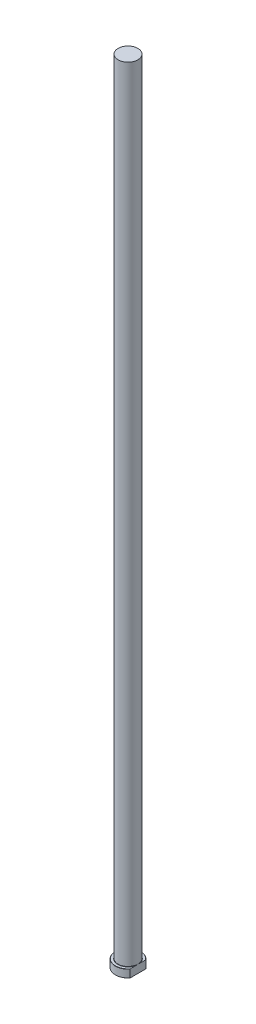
from build123d import *
from build123d.topology import SkipClean

# Parameters (mm, degrees)
CHAMFER1_SIZE = 0.2
FILLET1_R     = 0.3
KEY_DEPTH     = 1001.25596724


with BuildPart() as part:
    # Sketch1 → Revolve1 (revolve)
    with BuildSketch(Plane.XY, mode=Mode.PRIVATE) as revolve1_sk:
        Polygon((0, 0), (-16, 0), (-16, 10), (-12.5, 10), (-12.5, 1000), (0, 1000), align=None)
    revolve(revolve1_sk.sketch.rotate(Axis((0, 259.958771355, 0), (0, -1, 0)), 270), axis=Axis((0, 259.958771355, 0), (0, -1, 0)))

    # Chamfer1
    chamfer1_edges = [part.edges().sort_by_distance(p)[0] for p in [
        (0, 10, -16),
        (0, 0, -16),
    ]]
    chamfer(chamfer1_edges, length=CHAMFER1_SIZE)

    # Fillet1
    fillet1_edges = [part.edges().sort_by_distance(p)[0] for p in [
        (0, 10, -12.5),
    ]]
    fillet(fillet1_edges, radius=FILLET1_R)

    # Sketch2 → KEY (cut, through all)
    with SkipClean():  # the faces are left unmerged after this step: merging them gives an invalid solid
        with BuildSketch(Plane(origin=(0, 0, 0), x_dir=(1, 0, 0), z_dir=(0, 1, 0))):
            with BuildLine():
                Line((12.5, 9.987492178), (12.5, -9.987492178))
                ThreePointArc((12.5, -9.987492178), (16, 0), (12.5, 9.987492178))
            make_face()
        extrude(amount=KEY_DEPTH, mode=Mode.SUBTRACT)


solid = part.part
